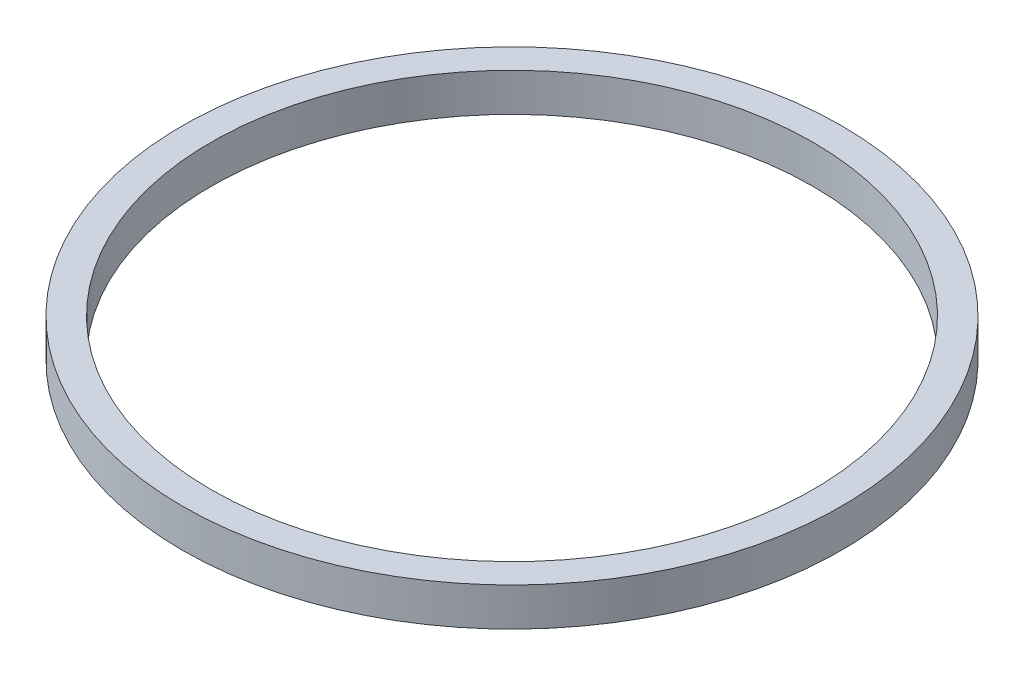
ISO-10303-21;
HEADER;
FILE_DESCRIPTION(('STEP AP214'),'2;1');
FILE_NAME('part.step','',(''),(''),'','','');
FILE_SCHEMA(('AUTOMOTIVE_DESIGN { 1 0 10303 214 1 1 1 1 }'));
ENDSEC;
DATA;
#1=APPLICATION_CONTEXT('core data for automotive mechanical design processes');
#2=APPLICATION_PROTOCOL_DEFINITION('international standard','automotive_design',2000,#1);
#3=PRODUCT_CONTEXT('',#1,'mechanical');
#4=PRODUCT('Part','Part','',(#3));
#5=PRODUCT_RELATED_PRODUCT_CATEGORY('part','',(#4));
#6=PRODUCT_DEFINITION_FORMATION('','',#4);
#7=PRODUCT_DEFINITION_CONTEXT('part definition',#1,'design');
#8=PRODUCT_DEFINITION('design','',#6,#7);
#9=PRODUCT_DEFINITION_SHAPE('','',#8);
#10=(LENGTH_UNIT() NAMED_UNIT(*) SI_UNIT(.MILLI.,.METRE.));
#11=(NAMED_UNIT(*) PLANE_ANGLE_UNIT() SI_UNIT($,.RADIAN.));
#12=(NAMED_UNIT(*) SI_UNIT($,.STERADIAN.) SOLID_ANGLE_UNIT());
#13=UNCERTAINTY_MEASURE_WITH_UNIT(LENGTH_MEASURE(1.E-05),#10,'distance_accuracy_value','');
#14=(GEOMETRIC_REPRESENTATION_CONTEXT(3) GLOBAL_UNCERTAINTY_ASSIGNED_CONTEXT((#13)) GLOBAL_UNIT_ASSIGNED_CONTEXT((#10,
#11,#12)) REPRESENTATION_CONTEXT('',''));
#15=CARTESIAN_POINT('',(0.,0.,0.));
#16=DIRECTION('',(0.,0.,1.));
#17=DIRECTION('',(1.,0.,0.));
#18=AXIS2_PLACEMENT_3D('',#15,#16,#17);
#19=CARTESIAN_POINT('',(0.,8.,0.));
#20=DIRECTION('',(0.,1.,0.));
#21=DIRECTION('',(0.,0.,1.));
#22=AXIS2_PLACEMENT_3D('',#19,#20,#21);
#23=PLANE('',#22);
#24=CARTESIAN_POINT('',(0.,8.,0.));
#25=DIRECTION('',(0.,1.,0.));
#26=DIRECTION('',(0.,0.,1.));
#27=AXIS2_PLACEMENT_3D('',#24,#25,#26);
#28=CIRCLE('',#27,34.5);
#29=CARTESIAN_POINT('',(0.,8.,34.5));
#30=VERTEX_POINT('',#29);
#31=EDGE_CURVE('E10',#30,#30,#28,.T.);
#32=ORIENTED_EDGE('',*,*,#31,.T.);
#33=EDGE_LOOP('',(#32));
#34=FACE_BOUND('',#33,.T.);
#35=CARTESIAN_POINT('',(0.,8.,0.));
#36=DIRECTION('',(0.,1.,0.));
#37=DIRECTION('',(0.,0.,1.));
#38=AXIS2_PLACEMENT_3D('',#35,#36,#37);
#39=CIRCLE('',#38,31.5);
#40=CARTESIAN_POINT('',(0.,8.,31.5));
#41=VERTEX_POINT('',#40);
#42=EDGE_CURVE('E44',#41,#41,#39,.T.);
#43=ORIENTED_EDGE('',*,*,#42,.F.);
#44=EDGE_LOOP('',(#43));
#45=FACE_BOUND('',#44,.T.);
#46=ADVANCED_FACE('F33',(#34,#45),#23,.T.);
#47=CARTESIAN_POINT('',(0.,4.,0.));
#48=DIRECTION('',(0.,1.,0.));
#49=DIRECTION('',(0.,0.,1.));
#50=AXIS2_PLACEMENT_3D('',#47,#48,#49);
#51=PLANE('',#50);
#52=CARTESIAN_POINT('',(0.,4.,0.));
#53=DIRECTION('',(0.,1.,0.));
#54=DIRECTION('',(0.,0.,1.));
#55=AXIS2_PLACEMENT_3D('',#52,#53,#54);
#56=CIRCLE('',#55,34.5);
#57=CARTESIAN_POINT('',(0.,4.,34.5));
#58=VERTEX_POINT('',#57);
#59=EDGE_CURVE('E37',#58,#58,#56,.T.);
#60=ORIENTED_EDGE('',*,*,#59,.F.);
#61=EDGE_LOOP('',(#60));
#62=FACE_BOUND('',#61,.T.);
#63=CARTESIAN_POINT('',(0.,4.,0.));
#64=DIRECTION('',(0.,1.,0.));
#65=DIRECTION('',(0.,0.,1.));
#66=AXIS2_PLACEMENT_3D('',#63,#64,#65);
#67=CIRCLE('',#66,31.5);
#68=CARTESIAN_POINT('',(0.,4.,31.5));
#69=VERTEX_POINT('',#68);
#70=EDGE_CURVE('E46',#69,#69,#67,.T.);
#71=ORIENTED_EDGE('',*,*,#70,.T.);
#72=EDGE_LOOP('',(#71));
#73=FACE_BOUND('',#72,.T.);
#74=ADVANCED_FACE('F56',(#62,#73),#51,.F.);
#75=CARTESIAN_POINT('',(0.,8.,0.));
#76=DIRECTION('',(0.,-1.,0.));
#77=DIRECTION('',(0.,0.,-1.));
#78=AXIS2_PLACEMENT_3D('',#75,#76,#77);
#79=CYLINDRICAL_SURFACE('',#78,34.5);
#80=ORIENTED_EDGE('',*,*,#31,.F.);
#81=EDGE_LOOP('',(#80));
#82=FACE_BOUND('',#81,.T.);
#83=ORIENTED_EDGE('',*,*,#59,.T.);
#84=EDGE_LOOP('',(#83));
#85=FACE_BOUND('',#84,.T.);
#86=ADVANCED_FACE('F35',(#82,#85),#79,.T.);
#87=CARTESIAN_POINT('',(0.,8.,0.));
#88=DIRECTION('',(0.,-1.,0.));
#89=DIRECTION('',(0.,0.,-1.));
#90=AXIS2_PLACEMENT_3D('',#87,#88,#89);
#91=CYLINDRICAL_SURFACE('',#90,31.5);
#92=ORIENTED_EDGE('',*,*,#42,.T.);
#93=EDGE_LOOP('',(#92));
#94=FACE_BOUND('',#93,.T.);
#95=ORIENTED_EDGE('',*,*,#70,.F.);
#96=EDGE_LOOP('',(#95));
#97=FACE_BOUND('',#96,.T.);
#98=ADVANCED_FACE('F52',(#94,#97),#91,.F.);
#99=CLOSED_SHELL('',(#46,#74,#86,#98));
#100=MANIFOLD_SOLID_BREP('B2',#99);
#101=ADVANCED_BREP_SHAPE_REPRESENTATION('',(#18,#100),#14);
#102=SHAPE_DEFINITION_REPRESENTATION(#9,#101);
ENDSEC;
END-ISO-10303-21;
